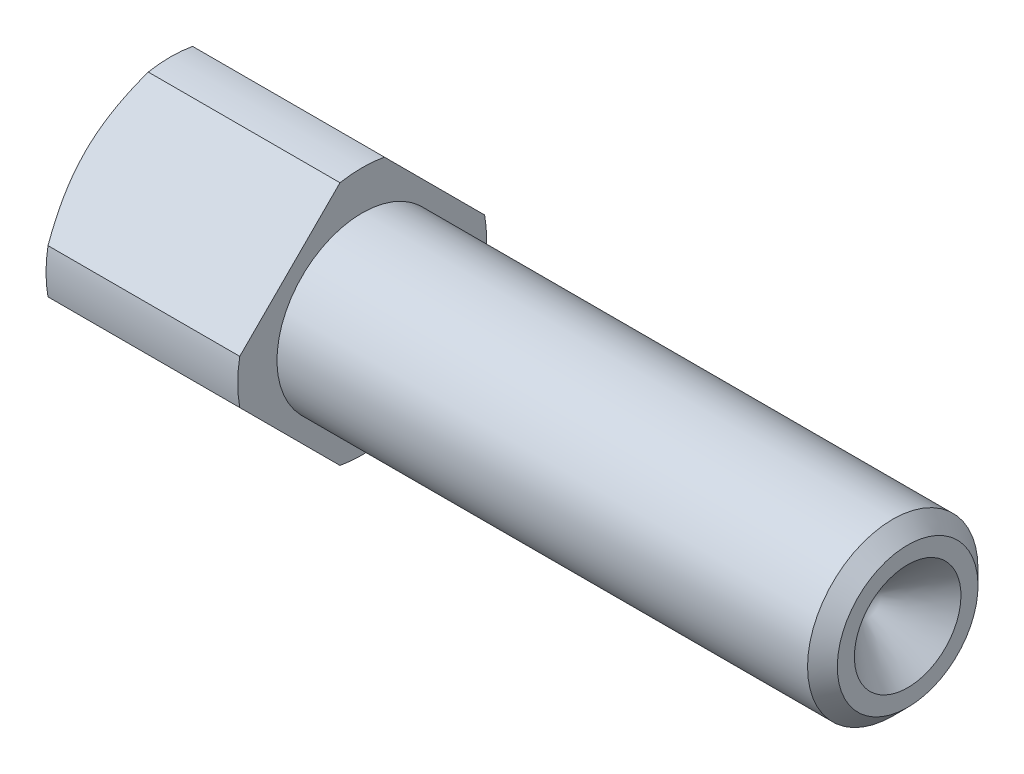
from build123d import *

# Parameters (mm, degrees)
SKETCH1_R          = 3.65
BASEHEAD_DEPTH     = 6
SKETCH2_OUTSIDE_W  = 11.688
SKETCH2_OUTSIDE_H  = 11.688
CUT_EXTRUDE1_DEPTH = 6
CHAMFER1_SIZE      = 0.436657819


with BuildPart() as part:
    # Sketch1 → BaseHead (new body)
    with BuildSketch(Plane(origin=(0, 0, 0), x_dir=(0, 0, -1), z_dir=(1, 0, 0))):
        Circle(SKETCH1_R)
    extrude(amount=BASEHEAD_DEPTH)

    # Sketch2 outside → Cut-Extrude1 (cut)
    with BuildSketch(Plane(origin=(0, -2.241457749, -0.246290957), x_dir=(0, 0, 1), z_dir=(-1, 0, 0))):
        with Locations((0.246, 2.241)):
            Rectangle(SKETCH2_OUTSIDE_W, SKETCH2_OUTSIDE_H)
        Polygon((4.488931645, 2.241457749), (0.246290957, 6.484098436), (-3.99634973, 2.241457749), (0.246290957, -2.001182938), align=None, mode=Mode.SUBTRACT)
    extrude(amount=-CUT_EXTRUDE1_DEPTH, mode=Mode.SUBTRACT)

    # Sketch3 → Cut-Revolve1 (revolve, cut)
    with BuildSketch(Plane(origin=(1.259716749, -5.274716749, 0), x_dir=(0, -1, 0), z_dir=(0, 0, 1))):
        Polygon((-9.289716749, -1.259716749), (-8.274716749, -1.259716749), (-9.289716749, -0.673706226), align=None)
    revolve(axis=Axis((1.545283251, 0, 0), (-1, 0, 0)), mode=Mode.SUBTRACT)

    # Sketch4 → BaseBody (revolve)
    with BuildSketch(Plane(origin=(-10.34721472, 12.84721472, 0), x_dir=(0, -1, 0), z_dir=(0, 0, 1)), mode=Mode.PRIVATE) as basebody_sk:
        Polygon((12.84721472, 16.34721472), (15.34721472, 16.34721472), (15.34721472, 32.34721472), (14.410556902, 32.34721472), (12.84721472, 30.783872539), align=None)
    revolve(basebody_sk.sketch.rotate(Axis((14.086803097, 0, 0), (-1, 0, 0)), 180), axis=Axis((14.086803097, 0, 0), (-1, 0, 0)))

    # Chamfer1
    chamfer1_edges = [part.edges().sort_by_distance(p)[0] for p in [
        (22, -2.5, 0),
    ]]
    chamfer(chamfer1_edges, length=CHAMFER1_SIZE)


solid = part.part
